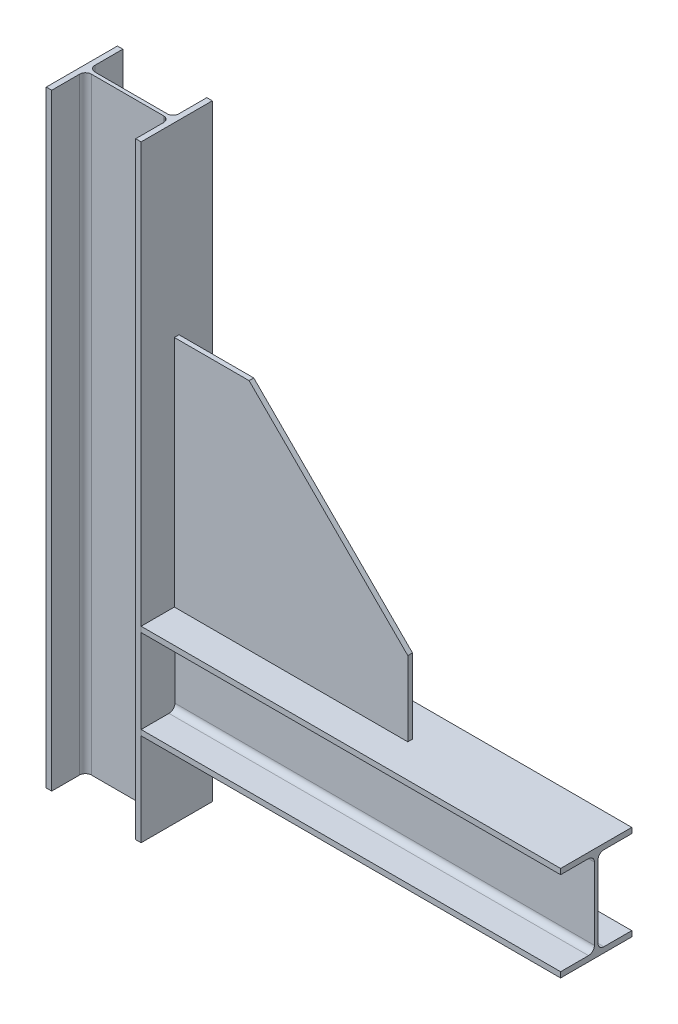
ISO-10303-21;
HEADER;
FILE_DESCRIPTION(('STEP AP214'),'2;1');
FILE_NAME('part.step','',(''),(''),'','','');
FILE_SCHEMA(('AUTOMOTIVE_DESIGN { 1 0 10303 214 1 1 1 1 }'));
ENDSEC;
DATA;
#1=APPLICATION_CONTEXT('core data for automotive mechanical design processes');
#2=APPLICATION_PROTOCOL_DEFINITION('international standard','automotive_design',2000,#1);
#3=PRODUCT_CONTEXT('',#1,'mechanical');
#4=PRODUCT('Part','Part','',(#3));
#5=PRODUCT_RELATED_PRODUCT_CATEGORY('part','',(#4));
#6=PRODUCT_DEFINITION_FORMATION('','',#4);
#7=PRODUCT_DEFINITION_CONTEXT('part definition',#1,'design');
#8=PRODUCT_DEFINITION('design','',#6,#7);
#9=PRODUCT_DEFINITION_SHAPE('','',#8);
#10=(LENGTH_UNIT() NAMED_UNIT(*) SI_UNIT(.MILLI.,.METRE.));
#11=(NAMED_UNIT(*) PLANE_ANGLE_UNIT() SI_UNIT($,.RADIAN.));
#12=(NAMED_UNIT(*) SI_UNIT($,.STERADIAN.) SOLID_ANGLE_UNIT());
#13=UNCERTAINTY_MEASURE_WITH_UNIT(LENGTH_MEASURE(1.E-05),#10,'distance_accuracy_value','');
#14=(GEOMETRIC_REPRESENTATION_CONTEXT(3) GLOBAL_UNCERTAINTY_ASSIGNED_CONTEXT((#13)) GLOBAL_UNIT_ASSIGNED_CONTEXT((#10,
#11,#12)) REPRESENTATION_CONTEXT('',''));
#15=CARTESIAN_POINT('',(0.,0.,0.));
#16=DIRECTION('',(0.,0.,1.));
#17=DIRECTION('',(1.,0.,0.));
#18=AXIS2_PLACEMENT_3D('',#15,#16,#17);
#19=CARTESIAN_POINT('',(50.8,300.8,2.50000000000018));
#20=DIRECTION('',(0.,-1.,0.));
#21=DIRECTION('',(0.,0.,-1.));
#22=AXIS2_PLACEMENT_3D('',#19,#20,#21);
#23=PLANE('',#22);
#24=DIRECTION('',(-1.,0.,0.));
#25=VECTOR('',#24,1.);
#26=CARTESIAN_POINT('',(50.8,300.8,-2.49999999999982));
#27=LINE('',#26,#25);
#28=CARTESIAN_POINT('',(130.8,300.8,-2.49999999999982));
#29=VERTEX_POINT('',#28);
#30=CARTESIAN_POINT('',(50.8,300.8,-2.49999999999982));
#31=VERTEX_POINT('',#30);
#32=EDGE_CURVE('E190',#29,#31,#27,.T.);
#33=ORIENTED_EDGE('',*,*,#32,.T.);
#34=DIRECTION('',(0.,0.,-1.));
#35=VECTOR('',#34,1.);
#36=CARTESIAN_POINT('',(50.8,300.8,2.50000000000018));
#37=LINE('',#36,#35);
#38=CARTESIAN_POINT('',(50.8,300.8,2.50000000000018));
#39=VERTEX_POINT('',#38);
#40=EDGE_CURVE('E14',#39,#31,#37,.T.);
#41=ORIENTED_EDGE('',*,*,#40,.F.);
#42=DIRECTION('',(-1.,0.,0.));
#43=VECTOR('',#42,1.);
#44=CARTESIAN_POINT('',(50.8,300.8,2.50000000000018));
#45=LINE('',#44,#43);
#46=CARTESIAN_POINT('',(130.8,300.8,2.50000000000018));
#47=VERTEX_POINT('',#46);
#48=EDGE_CURVE('E198',#47,#39,#45,.T.);
#49=ORIENTED_EDGE('',*,*,#48,.F.);
#50=DIRECTION('',(0.,0.,-1.));
#51=VECTOR('',#50,1.);
#52=CARTESIAN_POINT('',(130.8,300.8,2.50000000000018));
#53=LINE('',#52,#51);
#54=EDGE_CURVE('E186',#47,#29,#53,.T.);
#55=ORIENTED_EDGE('',*,*,#54,.T.);
#56=EDGE_LOOP('',(#33,#41,#49,#55));
#57=FACE_BOUND('',#56,.T.);
#58=ADVANCED_FACE('F116',(#57),#23,.F.);
#59=CARTESIAN_POINT('',(50.8000000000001,50.8,2.50000000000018));
#60=DIRECTION('',(1.,0.,0.));
#61=DIRECTION('',(0.,1.,0.));
#62=AXIS2_PLACEMENT_3D('',#59,#60,#61);
#63=PLANE('',#62);
#64=DIRECTION('',(0.,-1.,0.));
#65=VECTOR('',#64,1.);
#66=CARTESIAN_POINT('',(50.8000000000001,50.8,-2.49999999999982));
#67=LINE('',#66,#65);
#68=CARTESIAN_POINT('',(50.8000000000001,50.8,-2.49999999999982));
#69=VERTEX_POINT('',#68);
#70=EDGE_CURVE('E193',#31,#69,#67,.T.);
#71=ORIENTED_EDGE('',*,*,#70,.T.);
#72=DIRECTION('',(0.,0.,-1.));
#73=VECTOR('',#72,1.);
#74=CARTESIAN_POINT('',(50.8000000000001,50.8,2.50000000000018));
#75=LINE('',#74,#73);
#76=CARTESIAN_POINT('',(50.8000000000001,50.8,2.50000000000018));
#77=VERTEX_POINT('',#76);
#78=EDGE_CURVE('E124',#77,#69,#75,.T.);
#79=ORIENTED_EDGE('',*,*,#78,.F.);
#80=DIRECTION('',(0.,-1.,0.));
#81=VECTOR('',#80,1.);
#82=CARTESIAN_POINT('',(50.8000000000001,50.8,2.50000000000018));
#83=LINE('',#82,#81);
#84=EDGE_CURVE('E166',#39,#77,#83,.T.);
#85=ORIENTED_EDGE('',*,*,#84,.F.);
#86=ORIENTED_EDGE('',*,*,#40,.T.);
#87=EDGE_LOOP('',(#71,#79,#85,#86));
#88=FACE_BOUND('',#87,.T.);
#89=ADVANCED_FACE('F217',(#88),#63,.F.);
#90=CARTESIAN_POINT('',(50.8000000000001,50.8,2.50000000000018));
#91=DIRECTION('',(0.,1.,0.));
#92=DIRECTION('',(0.,0.,1.));
#93=AXIS2_PLACEMENT_3D('',#90,#91,#92);
#94=PLANE('',#93);
#95=DIRECTION('',(1.,0.,0.));
#96=VECTOR('',#95,1.);
#97=CARTESIAN_POINT('',(50.8000000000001,50.8,-2.49999999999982));
#98=LINE('',#97,#96);
#99=CARTESIAN_POINT('',(300.8,50.8,-2.49999999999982));
#100=VERTEX_POINT('',#99);
#101=EDGE_CURVE('E181',#69,#100,#98,.T.);
#102=ORIENTED_EDGE('',*,*,#101,.T.);
#103=DIRECTION('',(0.,0.,-1.));
#104=VECTOR('',#103,1.);
#105=CARTESIAN_POINT('',(300.8,50.8,2.50000000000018));
#106=LINE('',#105,#104);
#107=CARTESIAN_POINT('',(300.8,50.8,2.50000000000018));
#108=VERTEX_POINT('',#107);
#109=EDGE_CURVE('E178',#108,#100,#106,.T.);
#110=ORIENTED_EDGE('',*,*,#109,.F.);
#111=DIRECTION('',(1.,0.,0.));
#112=VECTOR('',#111,1.);
#113=CARTESIAN_POINT('',(50.8000000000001,50.8,2.50000000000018));
#114=LINE('',#113,#112);
#115=EDGE_CURVE('E170',#77,#108,#114,.T.);
#116=ORIENTED_EDGE('',*,*,#115,.F.);
#117=ORIENTED_EDGE('',*,*,#78,.T.);
#118=EDGE_LOOP('',(#102,#110,#116,#117));
#119=FACE_BOUND('',#118,.T.);
#120=ADVANCED_FACE('F179',(#119),#94,.F.);
#121=CARTESIAN_POINT('',(300.8,50.8,2.50000000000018));
#122=DIRECTION('',(-1.,0.,0.));
#123=DIRECTION('',(0.,0.,1.));
#124=AXIS2_PLACEMENT_3D('',#121,#122,#123);
#125=PLANE('',#124);
#126=DIRECTION('',(0.,1.,0.));
#127=VECTOR('',#126,1.);
#128=CARTESIAN_POINT('',(300.8,50.8,-2.49999999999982));
#129=LINE('',#128,#127);
#130=CARTESIAN_POINT('',(300.8,130.799999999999,-2.49999999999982));
#131=VERTEX_POINT('',#130);
#132=EDGE_CURVE('E152',#100,#131,#129,.T.);
#133=ORIENTED_EDGE('',*,*,#132,.T.);
#134=DIRECTION('',(0.,0.,-1.));
#135=VECTOR('',#134,1.);
#136=CARTESIAN_POINT('',(300.8,130.799999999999,2.50000000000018));
#137=LINE('',#136,#135);
#138=CARTESIAN_POINT('',(300.8,130.799999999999,2.50000000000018));
#139=VERTEX_POINT('',#138);
#140=EDGE_CURVE('E182',#139,#131,#137,.T.);
#141=ORIENTED_EDGE('',*,*,#140,.F.);
#142=DIRECTION('',(0.,1.,0.));
#143=VECTOR('',#142,1.);
#144=CARTESIAN_POINT('',(300.8,50.8,2.50000000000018));
#145=LINE('',#144,#143);
#146=EDGE_CURVE('E174',#108,#139,#145,.T.);
#147=ORIENTED_EDGE('',*,*,#146,.F.);
#148=ORIENTED_EDGE('',*,*,#109,.T.);
#149=EDGE_LOOP('',(#133,#141,#147,#148));
#150=FACE_BOUND('',#149,.T.);
#151=ADVANCED_FACE('F184',(#150),#125,.F.);
#152=CARTESIAN_POINT('',(130.8,300.8,2.50000000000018));
#153=DIRECTION('',(-0.707106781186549,-0.707106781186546,0.));
#154=DIRECTION('',(0.707106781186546,-0.707106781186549,0.));
#155=AXIS2_PLACEMENT_3D('',#152,#153,#154);
#156=PLANE('',#155);
#157=DIRECTION('',(-0.707106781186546,0.707106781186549,0.));
#158=VECTOR('',#157,1.);
#159=CARTESIAN_POINT('',(130.8,300.8,-2.49999999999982));
#160=LINE('',#159,#158);
#161=EDGE_CURVE('E158',#131,#29,#160,.T.);
#162=ORIENTED_EDGE('',*,*,#161,.T.);
#163=ORIENTED_EDGE('',*,*,#54,.F.);
#164=DIRECTION('',(-0.707106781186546,0.707106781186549,0.));
#165=VECTOR('',#164,1.);
#166=CARTESIAN_POINT('',(130.8,300.8,2.50000000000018));
#167=LINE('',#166,#165);
#168=EDGE_CURVE('E132',#139,#47,#167,.T.);
#169=ORIENTED_EDGE('',*,*,#168,.F.);
#170=ORIENTED_EDGE('',*,*,#140,.T.);
#171=EDGE_LOOP('',(#162,#163,#169,#170));
#172=FACE_BOUND('',#171,.T.);
#173=ADVANCED_FACE('F206',(#172),#156,.F.);
#174=CARTESIAN_POINT('',(0.,0.,2.50000000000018));
#175=DIRECTION('',(0.,0.,1.));
#176=DIRECTION('',(1.,0.,0.));
#177=AXIS2_PLACEMENT_3D('',#174,#175,#176);
#178=PLANE('',#177);
#179=ORIENTED_EDGE('',*,*,#48,.T.);
#180=ORIENTED_EDGE('',*,*,#84,.T.);
#181=ORIENTED_EDGE('',*,*,#115,.T.);
#182=ORIENTED_EDGE('',*,*,#146,.T.);
#183=ORIENTED_EDGE('',*,*,#168,.T.);
#184=EDGE_LOOP('',(#179,#180,#181,#182,#183));
#185=FACE_BOUND('',#184,.T.);
#186=ADVANCED_FACE('F172',(#185),#178,.T.);
#187=CARTESIAN_POINT('',(0.,0.,-2.49999999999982));
#188=DIRECTION('',(0.,0.,1.));
#189=DIRECTION('',(1.,0.,0.));
#190=AXIS2_PLACEMENT_3D('',#187,#188,#189);
#191=PLANE('',#190);
#192=ORIENTED_EDGE('',*,*,#32,.F.);
#193=ORIENTED_EDGE('',*,*,#161,.F.);
#194=ORIENTED_EDGE('',*,*,#132,.F.);
#195=ORIENTED_EDGE('',*,*,#101,.F.);
#196=ORIENTED_EDGE('',*,*,#70,.F.);
#197=EDGE_LOOP('',(#192,#193,#194,#195,#196));
#198=FACE_BOUND('',#197,.T.);
#199=ADVANCED_FACE('F202',(#198),#191,.F.);
#200=CLOSED_SHELL('',(#58,#89,#120,#151,#173,#186,#199));
#201=MANIFOLD_SOLID_BREP('B2',#200);
#202=CARTESIAN_POINT('',(500.,50.7999999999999,38.1000000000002));
#203=DIRECTION('',(0.,-1.,0.));
#204=DIRECTION('',(0.,0.,-1.));
#205=AXIS2_PLACEMENT_3D('',#202,#203,#204);
#206=PLANE('',#205);
#207=DIRECTION('',(0.,0.,-1.));
#208=VECTOR('',#207,1.);
#209=CARTESIAN_POINT('',(50.7999999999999,50.7999999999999,38.0999999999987));
#210=LINE('',#209,#208);
#211=CARTESIAN_POINT('',(50.7999999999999,50.7999999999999,38.1000000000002));
#212=VERTEX_POINT('',#211);
#213=CARTESIAN_POINT('',(50.8000000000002,50.8000000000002,-38.0999999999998));
#214=VERTEX_POINT('',#213);
#215=EDGE_CURVE('E403',#212,#214,#210,.T.);
#216=ORIENTED_EDGE('',*,*,#215,.F.);
#217=DIRECTION('',(-1.,0.,0.));
#218=VECTOR('',#217,1.);
#219=CARTESIAN_POINT('',(500.,50.7999999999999,38.1000000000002));
#220=LINE('',#219,#218);
#221=CARTESIAN_POINT('',(500.,50.7999999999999,38.1000000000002));
#222=VERTEX_POINT('',#221);
#223=EDGE_CURVE('E426',#222,#212,#220,.T.);
#224=ORIENTED_EDGE('',*,*,#223,.F.);
#225=DIRECTION('',(0.,0.,1.));
#226=VECTOR('',#225,1.);
#227=CARTESIAN_POINT('',(500.,50.7999999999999,38.1000000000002));
#228=LINE('',#227,#226);
#229=CARTESIAN_POINT('',(500.,50.8000000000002,-38.0999999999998));
#230=VERTEX_POINT('',#229);
#231=EDGE_CURVE('E425',#230,#222,#228,.T.);
#232=ORIENTED_EDGE('',*,*,#231,.F.);
#233=DIRECTION('',(-1.,0.,0.));
#234=VECTOR('',#233,1.);
#235=CARTESIAN_POINT('',(500.,50.8000000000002,-38.0999999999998));
#236=LINE('',#235,#234);
#237=EDGE_CURVE('E419',#230,#214,#236,.T.);
#238=ORIENTED_EDGE('',*,*,#237,.T.);
#239=EDGE_LOOP('',(#216,#224,#232,#238));
#240=FACE_BOUND('',#239,.T.);
#241=ADVANCED_FACE('F289',(#240),#206,.F.);
#242=CARTESIAN_POINT('',(500.,44.9579999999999,38.1000000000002));
#243=DIRECTION('',(0.,0.,-1.));
#244=DIRECTION('',(0.,1.,0.));
#245=AXIS2_PLACEMENT_3D('',#242,#243,#244);
#246=PLANE('',#245);
#247=DIRECTION('',(0.,1.,0.));
#248=VECTOR('',#247,1.);
#249=CARTESIAN_POINT('',(50.8,-150.,38.1000000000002));
#250=LINE('',#249,#248);
#251=CARTESIAN_POINT('',(50.7999999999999,44.9579999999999,38.1000000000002));
#252=VERTEX_POINT('',#251);
#253=EDGE_CURVE('E114',#252,#212,#250,.T.);
#254=ORIENTED_EDGE('',*,*,#253,.F.);
#255=DIRECTION('',(-1.,0.,0.));
#256=VECTOR('',#255,1.);
#257=CARTESIAN_POINT('',(500.,44.9579999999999,38.1000000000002));
#258=LINE('',#257,#256);
#259=CARTESIAN_POINT('',(500.,44.9579999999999,38.1000000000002));
#260=VERTEX_POINT('',#259);
#261=EDGE_CURVE('E428',#260,#252,#258,.T.);
#262=ORIENTED_EDGE('',*,*,#261,.F.);
#263=DIRECTION('',(0.,-1.,0.));
#264=VECTOR('',#263,1.);
#265=CARTESIAN_POINT('',(500.,44.9579999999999,38.1000000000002));
#266=LINE('',#265,#264);
#267=EDGE_CURVE('E441',#222,#260,#266,.T.);
#268=ORIENTED_EDGE('',*,*,#267,.F.);
#269=ORIENTED_EDGE('',*,*,#223,.T.);
#270=EDGE_LOOP('',(#254,#262,#268,#269));
#271=FACE_BOUND('',#270,.T.);
#272=ADVANCED_FACE('F557',(#271),#246,.F.);
#273=CARTESIAN_POINT('',(500.,44.9579999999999,8.25500000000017));
#274=DIRECTION('',(0.,1.,0.));
#275=DIRECTION('',(0.,0.,1.));
#276=AXIS2_PLACEMENT_3D('',#273,#274,#275);
#277=PLANE('',#276);
#278=DIRECTION('',(0.,0.,1.));
#279=VECTOR('',#278,1.);
#280=CARTESIAN_POINT('',(50.8,44.9579999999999,8.25499999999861));
#281=LINE('',#280,#279);
#282=CARTESIAN_POINT('',(50.8,44.958,8.25500000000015));
#283=VERTEX_POINT('',#282);
#284=EDGE_CURVE('E298',#283,#252,#281,.T.);
#285=ORIENTED_EDGE('',*,*,#284,.F.);
#286=DIRECTION('',(-1.,0.,0.));
#287=VECTOR('',#286,1.);
#288=CARTESIAN_POINT('',(500.,44.958,8.25500000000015));
#289=LINE('',#288,#287);
#290=CARTESIAN_POINT('',(500.,44.958,8.25500000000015));
#291=VERTEX_POINT('',#290);
#292=EDGE_CURVE('E471',#291,#283,#289,.T.);
#293=ORIENTED_EDGE('',*,*,#292,.F.);
#294=DIRECTION('',(0.,0.,-1.));
#295=VECTOR('',#294,1.);
#296=CARTESIAN_POINT('',(500.,44.9579999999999,8.25500000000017));
#297=LINE('',#296,#295);
#298=EDGE_CURVE('E444',#260,#291,#297,.T.);
#299=ORIENTED_EDGE('',*,*,#298,.F.);
#300=ORIENTED_EDGE('',*,*,#261,.T.);
#301=EDGE_LOOP('',(#285,#293,#299,#300));
#302=FACE_BOUND('',#301,.T.);
#303=ADVANCED_FACE('F554',(#302),#277,.F.);
#304=CARTESIAN_POINT('',(500.,38.608,8.25500000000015));
#305=DIRECTION('',(-1.,0.,0.));
#306=DIRECTION('',(0.,0.,1.));
#307=AXIS2_PLACEMENT_3D('',#304,#305,#306);
#308=CYLINDRICAL_SURFACE('',#307,6.34999999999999);
#309=CARTESIAN_POINT('',(50.8,38.608,8.25500000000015));
#310=DIRECTION('',(-1.,0.,0.));
#311=DIRECTION('',(0.,0.,1.));
#312=AXIS2_PLACEMENT_3D('',#309,#310,#311);
#313=CIRCLE('',#312,6.34999999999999);
#314=CARTESIAN_POINT('',(50.8000000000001,38.608,1.90500000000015));
#315=VERTEX_POINT('',#314);
#316=EDGE_CURVE('E449',#315,#283,#313,.F.);
#317=ORIENTED_EDGE('',*,*,#316,.F.);
#318=DIRECTION('',(-1.,0.,0.));
#319=VECTOR('',#318,1.);
#320=CARTESIAN_POINT('',(500.,38.608,1.90500000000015));
#321=LINE('',#320,#319);
#322=CARTESIAN_POINT('',(500.,38.608,1.90500000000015));
#323=VERTEX_POINT('',#322);
#324=EDGE_CURVE('E474',#323,#315,#321,.T.);
#325=ORIENTED_EDGE('',*,*,#324,.F.);
#326=CARTESIAN_POINT('',(500.,38.608,8.25500000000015));
#327=DIRECTION('',(-1.,0.,0.));
#328=DIRECTION('',(0.,1.,0.));
#329=AXIS2_PLACEMENT_3D('',#326,#327,#328);
#330=CIRCLE('',#329,6.34999999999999);
#331=EDGE_CURVE('E551',#291,#323,#330,.T.);
#332=ORIENTED_EDGE('',*,*,#331,.F.);
#333=ORIENTED_EDGE('',*,*,#292,.T.);
#334=EDGE_LOOP('',(#317,#325,#332,#333));
#335=FACE_BOUND('',#334,.T.);
#336=ADVANCED_FACE('F548',(#335),#308,.F.);
#337=CARTESIAN_POINT('',(500.,-38.608,1.90499999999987));
#338=DIRECTION('',(0.,0.,-1.));
#339=DIRECTION('',(0.,1.,0.));
#340=AXIS2_PLACEMENT_3D('',#337,#338,#339);
#341=PLANE('',#340);
#342=DIRECTION('',(0.,1.,0.));
#343=VECTOR('',#342,1.);
#344=CARTESIAN_POINT('',(50.8000000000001,-38.6080000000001,1.90499999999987));
#345=LINE('',#344,#343);
#346=CARTESIAN_POINT('',(50.8000000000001,-38.608,1.90499999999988));
#347=VERTEX_POINT('',#346);
#348=EDGE_CURVE('E451',#347,#315,#345,.T.);
#349=ORIENTED_EDGE('',*,*,#348,.F.);
#350=DIRECTION('',(-1.,0.,0.));
#351=VECTOR('',#350,1.);
#352=CARTESIAN_POINT('',(500.,-38.608,1.90499999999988));
#353=LINE('',#352,#351);
#354=CARTESIAN_POINT('',(500.,-38.608,1.90499999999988));
#355=VERTEX_POINT('',#354);
#356=EDGE_CURVE('E477',#355,#347,#353,.T.);
#357=ORIENTED_EDGE('',*,*,#356,.F.);
#358=DIRECTION('',(0.,-1.,0.));
#359=VECTOR('',#358,1.);
#360=CARTESIAN_POINT('',(500.,-38.608,1.90499999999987));
#361=LINE('',#360,#359);
#362=EDGE_CURVE('E543',#323,#355,#361,.T.);
#363=ORIENTED_EDGE('',*,*,#362,.F.);
#364=ORIENTED_EDGE('',*,*,#324,.T.);
#365=EDGE_LOOP('',(#349,#357,#363,#364));
#366=FACE_BOUND('',#365,.T.);
#367=ADVANCED_FACE('F542',(#366),#341,.F.);
#368=CARTESIAN_POINT('',(500.,-38.608,8.25499999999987));
#369=DIRECTION('',(-1.,0.,0.));
#370=DIRECTION('',(0.,0.,1.));
#371=AXIS2_PLACEMENT_3D('',#368,#369,#370);
#372=CYLINDRICAL_SURFACE('',#371,6.34999999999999);
#373=CARTESIAN_POINT('',(50.8000000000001,-38.608,8.25499999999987));
#374=DIRECTION('',(-1.,0.,0.));
#375=DIRECTION('',(0.,0.,1.));
#376=AXIS2_PLACEMENT_3D('',#373,#374,#375);
#377=CIRCLE('',#376,6.34999999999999);
#378=CARTESIAN_POINT('',(50.8000000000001,-44.958,8.25499999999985));
#379=VERTEX_POINT('',#378);
#380=EDGE_CURVE('E453',#379,#347,#377,.F.);
#381=ORIENTED_EDGE('',*,*,#380,.F.);
#382=DIRECTION('',(-1.,0.,0.));
#383=VECTOR('',#382,1.);
#384=CARTESIAN_POINT('',(500.,-44.958,8.25499999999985));
#385=LINE('',#384,#383);
#386=CARTESIAN_POINT('',(500.,-44.958,8.25499999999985));
#387=VERTEX_POINT('',#386);
#388=EDGE_CURVE('E480',#387,#379,#385,.T.);
#389=ORIENTED_EDGE('',*,*,#388,.F.);
#390=CARTESIAN_POINT('',(500.,-38.608,8.25499999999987));
#391=DIRECTION('',(-1.,0.,0.));
#392=DIRECTION('',(0.,1.,0.));
#393=AXIS2_PLACEMENT_3D('',#390,#391,#392);
#394=CIRCLE('',#393,6.34999999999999);
#395=EDGE_CURVE('E539',#355,#387,#394,.T.);
#396=ORIENTED_EDGE('',*,*,#395,.F.);
#397=ORIENTED_EDGE('',*,*,#356,.T.);
#398=EDGE_LOOP('',(#381,#389,#396,#397));
#399=FACE_BOUND('',#398,.T.);
#400=ADVANCED_FACE('F536',(#399),#372,.F.);
#401=CARTESIAN_POINT('',(500.,-44.9580000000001,38.0999999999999));
#402=DIRECTION('',(0.,-1.,0.));
#403=DIRECTION('',(0.,0.,-1.));
#404=AXIS2_PLACEMENT_3D('',#401,#402,#403);
#405=PLANE('',#404);
#406=DIRECTION('',(0.,0.,-1.));
#407=VECTOR('',#406,1.);
#408=CARTESIAN_POINT('',(50.8,-44.9580000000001,38.0999999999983));
#409=LINE('',#408,#407);
#410=CARTESIAN_POINT('',(50.8,-44.9580000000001,38.1000000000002));
#411=VERTEX_POINT('',#410);
#412=EDGE_CURVE('E455',#411,#379,#409,.T.);
#413=ORIENTED_EDGE('',*,*,#412,.F.);
#414=DIRECTION('',(-1.,0.,0.));
#415=VECTOR('',#414,1.);
#416=CARTESIAN_POINT('',(500.,-44.9580000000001,38.0999999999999));
#417=LINE('',#416,#415);
#418=CARTESIAN_POINT('',(500.,-44.9580000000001,38.0999999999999));
#419=VERTEX_POINT('',#418);
#420=EDGE_CURVE('E483',#419,#411,#417,.T.);
#421=ORIENTED_EDGE('',*,*,#420,.F.);
#422=DIRECTION('',(0.,0.,1.));
#423=VECTOR('',#422,1.);
#424=CARTESIAN_POINT('',(500.,-44.9580000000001,38.0999999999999));
#425=LINE('',#424,#423);
#426=EDGE_CURVE('E531',#387,#419,#425,.T.);
#427=ORIENTED_EDGE('',*,*,#426,.F.);
#428=ORIENTED_EDGE('',*,*,#388,.T.);
#429=EDGE_LOOP('',(#413,#421,#427,#428));
#430=FACE_BOUND('',#429,.T.);
#431=ADVANCED_FACE('F530',(#430),#405,.F.);
#432=CARTESIAN_POINT('',(500.,-50.8000000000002,38.0999999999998));
#433=DIRECTION('',(0.,0.,-1.));
#434=DIRECTION('',(0.,1.,0.));
#435=AXIS2_PLACEMENT_3D('',#432,#433,#434);
#436=PLANE('',#435);
#437=CARTESIAN_POINT('',(50.8,-50.8000000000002,38.1000000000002));
#438=VERTEX_POINT('',#437);
#439=EDGE_CURVE('E300',#438,#411,#250,.T.);
#440=ORIENTED_EDGE('',*,*,#439,.F.);
#441=DIRECTION('',(-1.,0.,0.));
#442=VECTOR('',#441,1.);
#443=CARTESIAN_POINT('',(500.,-50.8000000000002,38.0999999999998));
#444=LINE('',#443,#442);
#445=CARTESIAN_POINT('',(500.,-50.8000000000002,38.0999999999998));
#446=VERTEX_POINT('',#445);
#447=EDGE_CURVE('E467',#446,#438,#444,.T.);
#448=ORIENTED_EDGE('',*,*,#447,.F.);
#449=DIRECTION('',(0.,-1.,0.));
#450=VECTOR('',#449,1.);
#451=CARTESIAN_POINT('',(500.,-50.8000000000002,38.0999999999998));
#452=LINE('',#451,#450);
#453=EDGE_CURVE('E526',#419,#446,#452,.T.);
#454=ORIENTED_EDGE('',*,*,#453,.F.);
#455=ORIENTED_EDGE('',*,*,#420,.T.);
#456=EDGE_LOOP('',(#440,#448,#454,#455));
#457=FACE_BOUND('',#456,.T.);
#458=ADVANCED_FACE('F525',(#457),#436,.F.);
#459=CARTESIAN_POINT('',(500.,-50.7999999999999,-38.1000000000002));
#460=DIRECTION('',(0.,1.,0.));
#461=DIRECTION('',(0.,0.,1.));
#462=AXIS2_PLACEMENT_3D('',#459,#460,#461);
#463=PLANE('',#462);
#464=DIRECTION('',(0.,0.,1.));
#465=VECTOR('',#464,1.);
#466=CARTESIAN_POINT('',(50.8000000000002,-50.7999999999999,-38.1000000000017));
#467=LINE('',#466,#465);
#468=CARTESIAN_POINT('',(50.8000000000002,-50.7999999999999,-38.0999999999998));
#469=VERTEX_POINT('',#468);
#470=EDGE_CURVE('E324',#469,#438,#467,.T.);
#471=ORIENTED_EDGE('',*,*,#470,.F.);
#472=DIRECTION('',(-1.,0.,0.));
#473=VECTOR('',#472,1.);
#474=CARTESIAN_POINT('',(500.,-50.7999999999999,-38.1000000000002));
#475=LINE('',#474,#473);
#476=CARTESIAN_POINT('',(500.,-50.7999999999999,-38.1000000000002));
#477=VERTEX_POINT('',#476);
#478=EDGE_CURVE('E466',#477,#469,#475,.T.);
#479=ORIENTED_EDGE('',*,*,#478,.F.);
#480=DIRECTION('',(0.,0.,-1.));
#481=VECTOR('',#480,1.);
#482=CARTESIAN_POINT('',(500.,-50.7999999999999,-38.1000000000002));
#483=LINE('',#482,#481);
#484=EDGE_CURVE('E521',#446,#477,#483,.T.);
#485=ORIENTED_EDGE('',*,*,#484,.F.);
#486=ORIENTED_EDGE('',*,*,#447,.T.);
#487=EDGE_LOOP('',(#471,#479,#485,#486));
#488=FACE_BOUND('',#487,.T.);
#489=ADVANCED_FACE('F520',(#488),#463,.F.);
#490=CARTESIAN_POINT('',(500.,-44.9579999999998,-38.1000000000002));
#491=DIRECTION('',(0.,0.,1.));
#492=DIRECTION('',(0.,-1.,0.));
#493=AXIS2_PLACEMENT_3D('',#490,#491,#492);
#494=PLANE('',#493);
#495=DIRECTION('',(0.,1.,0.));
#496=VECTOR('',#495,1.);
#497=CARTESIAN_POINT('',(50.8000000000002,-150.,-38.0999999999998));
#498=LINE('',#497,#496);
#499=CARTESIAN_POINT('',(50.8000000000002,-44.9579999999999,-38.0999999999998));
#500=VERTEX_POINT('',#499);
#501=EDGE_CURVE('E328',#469,#500,#498,.T.);
#502=ORIENTED_EDGE('',*,*,#501,.T.);
#503=DIRECTION('',(-1.,0.,0.));
#504=VECTOR('',#503,1.);
#505=CARTESIAN_POINT('',(500.,-44.9579999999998,-38.1000000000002));
#506=LINE('',#505,#504);
#507=CARTESIAN_POINT('',(500.,-44.9579999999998,-38.1000000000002));
#508=VERTEX_POINT('',#507);
#509=EDGE_CURVE('E490',#508,#500,#506,.T.);
#510=ORIENTED_EDGE('',*,*,#509,.F.);
#511=DIRECTION('',(0.,1.,0.));
#512=VECTOR('',#511,1.);
#513=CARTESIAN_POINT('',(500.,-44.9579999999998,-38.1000000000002));
#514=LINE('',#513,#512);
#515=EDGE_CURVE('E516',#477,#508,#514,.T.);
#516=ORIENTED_EDGE('',*,*,#515,.F.);
#517=ORIENTED_EDGE('',*,*,#478,.T.);
#518=EDGE_LOOP('',(#502,#510,#516,#517));
#519=FACE_BOUND('',#518,.T.);
#520=ADVANCED_FACE('F515',(#519),#494,.F.);
#521=CARTESIAN_POINT('',(500.,-44.9579999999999,-8.25500000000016));
#522=DIRECTION('',(0.,-1.,0.));
#523=DIRECTION('',(0.,0.,-1.));
#524=AXIS2_PLACEMENT_3D('',#521,#522,#523);
#525=PLANE('',#524);
#526=DIRECTION('',(0.,0.,-1.));
#527=VECTOR('',#526,1.);
#528=CARTESIAN_POINT('',(50.8000000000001,-44.9579999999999,-8.25500000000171));
#529=LINE('',#528,#527);
#530=CARTESIAN_POINT('',(50.8000000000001,-44.958,-8.25500000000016));
#531=VERTEX_POINT('',#530);
#532=EDGE_CURVE('E332',#531,#500,#529,.T.);
#533=ORIENTED_EDGE('',*,*,#532,.F.);
#534=DIRECTION('',(-1.,0.,0.));
#535=VECTOR('',#534,1.);
#536=CARTESIAN_POINT('',(500.,-44.958,-8.25500000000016));
#537=LINE('',#536,#535);
#538=CARTESIAN_POINT('',(500.,-44.958,-8.25500000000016));
#539=VERTEX_POINT('',#538);
#540=EDGE_CURVE('E492',#539,#531,#537,.T.);
#541=ORIENTED_EDGE('',*,*,#540,.F.);
#542=DIRECTION('',(0.,0.,1.));
#543=VECTOR('',#542,1.);
#544=CARTESIAN_POINT('',(500.,-44.9579999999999,-8.25500000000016));
#545=LINE('',#544,#543);
#546=EDGE_CURVE('E512',#508,#539,#545,.T.);
#547=ORIENTED_EDGE('',*,*,#546,.F.);
#548=ORIENTED_EDGE('',*,*,#509,.T.);
#549=EDGE_LOOP('',(#533,#541,#547,#548));
#550=FACE_BOUND('',#549,.T.);
#551=ADVANCED_FACE('F509',(#550),#525,.F.);
#552=CARTESIAN_POINT('',(500.,-38.608,-8.25500000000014));
#553=DIRECTION('',(-1.,0.,0.));
#554=DIRECTION('',(0.,0.,1.));
#555=AXIS2_PLACEMENT_3D('',#552,#553,#554);
#556=CYLINDRICAL_SURFACE('',#555,6.34999999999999);
#557=CARTESIAN_POINT('',(50.8000000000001,-38.608,-8.25500000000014));
#558=DIRECTION('',(-1.,0.,0.));
#559=DIRECTION('',(0.,0.,1.));
#560=AXIS2_PLACEMENT_3D('',#557,#558,#559);
#561=CIRCLE('',#560,6.34999999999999);
#562=CARTESIAN_POINT('',(50.8,-38.608,-1.90500000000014));
#563=VERTEX_POINT('',#562);
#564=EDGE_CURVE('E459',#563,#531,#561,.F.);
#565=ORIENTED_EDGE('',*,*,#564,.F.);
#566=DIRECTION('',(-1.,0.,0.));
#567=VECTOR('',#566,1.);
#568=CARTESIAN_POINT('',(500.,-38.608,-1.90500000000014));
#569=LINE('',#568,#567);
#570=CARTESIAN_POINT('',(500.,-38.608,-1.90500000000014));
#571=VERTEX_POINT('',#570);
#572=EDGE_CURVE('E432',#571,#563,#569,.T.);
#573=ORIENTED_EDGE('',*,*,#572,.F.);
#574=CARTESIAN_POINT('',(500.,-38.608,-8.25500000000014));
#575=DIRECTION('',(-1.,0.,0.));
#576=DIRECTION('',(0.,1.,0.));
#577=AXIS2_PLACEMENT_3D('',#574,#575,#576);
#578=CIRCLE('',#577,6.34999999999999);
#579=EDGE_CURVE('E507',#539,#571,#578,.T.);
#580=ORIENTED_EDGE('',*,*,#579,.F.);
#581=ORIENTED_EDGE('',*,*,#540,.T.);
#582=EDGE_LOOP('',(#565,#573,#580,#581));
#583=FACE_BOUND('',#582,.T.);
#584=ADVANCED_FACE('F506',(#583),#556,.F.);
#585=CARTESIAN_POINT('',(500.,38.608,-1.90499999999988));
#586=DIRECTION('',(0.,0.,1.));
#587=DIRECTION('',(0.,-1.,0.));
#588=AXIS2_PLACEMENT_3D('',#585,#586,#587);
#589=PLANE('',#588);
#590=DIRECTION('',(0.,-1.,0.));
#591=VECTOR('',#590,1.);
#592=CARTESIAN_POINT('',(50.8,38.6079999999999,-1.90499999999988));
#593=LINE('',#592,#591);
#594=CARTESIAN_POINT('',(50.8,38.608,-1.90499999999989));
#595=VERTEX_POINT('',#594);
#596=EDGE_CURVE('E461',#595,#563,#593,.T.);
#597=ORIENTED_EDGE('',*,*,#596,.F.);
#598=DIRECTION('',(-1.,0.,0.));
#599=VECTOR('',#598,1.);
#600=CARTESIAN_POINT('',(500.,38.608,-1.90499999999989));
#601=LINE('',#600,#599);
#602=CARTESIAN_POINT('',(500.,38.608,-1.90499999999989));
#603=VERTEX_POINT('',#602);
#604=EDGE_CURVE('E434',#603,#595,#601,.T.);
#605=ORIENTED_EDGE('',*,*,#604,.F.);
#606=DIRECTION('',(0.,1.,0.));
#607=VECTOR('',#606,1.);
#608=CARTESIAN_POINT('',(500.,38.608,-1.90499999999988));
#609=LINE('',#608,#607);
#610=EDGE_CURVE('E505',#571,#603,#609,.T.);
#611=ORIENTED_EDGE('',*,*,#610,.F.);
#612=ORIENTED_EDGE('',*,*,#572,.T.);
#613=EDGE_LOOP('',(#597,#605,#611,#612));
#614=FACE_BOUND('',#613,.T.);
#615=ADVANCED_FACE('F503',(#614),#589,.F.);
#616=CARTESIAN_POINT('',(500.,38.608,-8.25499999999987));
#617=DIRECTION('',(-1.,0.,0.));
#618=DIRECTION('',(0.,0.,1.));
#619=AXIS2_PLACEMENT_3D('',#616,#617,#618);
#620=CYLINDRICAL_SURFACE('',#619,6.34999999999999);
#621=CARTESIAN_POINT('',(50.8000000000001,38.608,-8.25499999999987));
#622=DIRECTION('',(-1.,0.,0.));
#623=DIRECTION('',(0.,0.,1.));
#624=AXIS2_PLACEMENT_3D('',#621,#622,#623);
#625=CIRCLE('',#624,6.34999999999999);
#626=CARTESIAN_POINT('',(50.8000000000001,44.958,-8.25499999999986));
#627=VERTEX_POINT('',#626);
#628=EDGE_CURVE('E463',#627,#595,#625,.F.);
#629=ORIENTED_EDGE('',*,*,#628,.F.);
#630=DIRECTION('',(-1.,0.,0.));
#631=VECTOR('',#630,1.);
#632=CARTESIAN_POINT('',(500.,44.958,-8.25499999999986));
#633=LINE('',#632,#631);
#634=CARTESIAN_POINT('',(500.,44.958,-8.25499999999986));
#635=VERTEX_POINT('',#634);
#636=EDGE_CURVE('E436',#635,#627,#633,.T.);
#637=ORIENTED_EDGE('',*,*,#636,.F.);
#638=CARTESIAN_POINT('',(500.,38.608,-8.25499999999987));
#639=DIRECTION('',(-1.,0.,0.));
#640=DIRECTION('',(0.,1.,0.));
#641=AXIS2_PLACEMENT_3D('',#638,#639,#640);
#642=CIRCLE('',#641,6.34999999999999);
#643=EDGE_CURVE('E570',#603,#635,#642,.T.);
#644=ORIENTED_EDGE('',*,*,#643,.F.);
#645=ORIENTED_EDGE('',*,*,#604,.T.);
#646=EDGE_LOOP('',(#629,#637,#644,#645));
#647=FACE_BOUND('',#646,.T.);
#648=ADVANCED_FACE('F578',(#647),#620,.F.);
#649=CARTESIAN_POINT('',(500.,44.9580000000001,-38.0999999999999));
#650=DIRECTION('',(0.,1.,0.));
#651=DIRECTION('',(0.,0.,1.));
#652=AXIS2_PLACEMENT_3D('',#649,#650,#651);
#653=PLANE('',#652);
#654=DIRECTION('',(0.,0.,1.));
#655=VECTOR('',#654,1.);
#656=CARTESIAN_POINT('',(50.8000000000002,44.9580000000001,-38.1000000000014));
#657=LINE('',#656,#655);
#658=CARTESIAN_POINT('',(50.8000000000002,44.9580000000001,-38.0999999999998));
#659=VERTEX_POINT('',#658);
#660=EDGE_CURVE('E422',#659,#627,#657,.T.);
#661=ORIENTED_EDGE('',*,*,#660,.F.);
#662=DIRECTION('',(-1.,0.,0.));
#663=VECTOR('',#662,1.);
#664=CARTESIAN_POINT('',(500.,44.9580000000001,-38.0999999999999));
#665=LINE('',#664,#663);
#666=CARTESIAN_POINT('',(500.,44.9580000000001,-38.0999999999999));
#667=VERTEX_POINT('',#666);
#668=EDGE_CURVE('E292',#667,#659,#665,.T.);
#669=ORIENTED_EDGE('',*,*,#668,.F.);
#670=DIRECTION('',(0.,0.,-1.));
#671=VECTOR('',#670,1.);
#672=CARTESIAN_POINT('',(500.,44.9580000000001,-38.0999999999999));
#673=LINE('',#672,#671);
#674=EDGE_CURVE('E572',#635,#667,#673,.T.);
#675=ORIENTED_EDGE('',*,*,#674,.F.);
#676=ORIENTED_EDGE('',*,*,#636,.T.);
#677=EDGE_LOOP('',(#661,#669,#675,#676));
#678=FACE_BOUND('',#677,.T.);
#679=ADVANCED_FACE('F575',(#678),#653,.F.);
#680=CARTESIAN_POINT('',(500.,50.8000000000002,-38.0999999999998));
#681=DIRECTION('',(0.,0.,1.));
#682=DIRECTION('',(0.,-1.,0.));
#683=AXIS2_PLACEMENT_3D('',#680,#681,#682);
#684=PLANE('',#683);
#685=DIRECTION('',(0.,-1.,0.));
#686=VECTOR('',#685,1.);
#687=CARTESIAN_POINT('',(50.8000000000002,50.8000000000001,-38.0999999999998));
#688=LINE('',#687,#686);
#689=EDGE_CURVE('E406',#214,#659,#688,.T.);
#690=ORIENTED_EDGE('',*,*,#689,.F.);
#691=ORIENTED_EDGE('',*,*,#237,.F.);
#692=DIRECTION('',(0.,1.,0.));
#693=VECTOR('',#692,1.);
#694=CARTESIAN_POINT('',(500.,50.8000000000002,-38.0999999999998));
#695=LINE('',#694,#693);
#696=EDGE_CURVE('E412',#667,#230,#695,.T.);
#697=ORIENTED_EDGE('',*,*,#696,.F.);
#698=ORIENTED_EDGE('',*,*,#668,.T.);
#699=EDGE_LOOP('',(#690,#691,#697,#698));
#700=FACE_BOUND('',#699,.T.);
#701=ADVANCED_FACE('F417',(#700),#684,.F.);
#702=CARTESIAN_POINT('',(500.,38.608,-8.25499999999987));
#703=DIRECTION('',(1.,0.,0.));
#704=DIRECTION('',(0.,1.,0.));
#705=AXIS2_PLACEMENT_3D('',#702,#703,#704);
#706=PLANE('',#705);
#707=ORIENTED_EDGE('',*,*,#231,.T.);
#708=ORIENTED_EDGE('',*,*,#267,.T.);
#709=ORIENTED_EDGE('',*,*,#298,.T.);
#710=ORIENTED_EDGE('',*,*,#331,.T.);
#711=ORIENTED_EDGE('',*,*,#362,.T.);
#712=ORIENTED_EDGE('',*,*,#395,.T.);
#713=ORIENTED_EDGE('',*,*,#426,.T.);
#714=ORIENTED_EDGE('',*,*,#453,.T.);
#715=ORIENTED_EDGE('',*,*,#484,.T.);
#716=ORIENTED_EDGE('',*,*,#515,.T.);
#717=ORIENTED_EDGE('',*,*,#546,.T.);
#718=ORIENTED_EDGE('',*,*,#579,.T.);
#719=ORIENTED_EDGE('',*,*,#610,.T.);
#720=ORIENTED_EDGE('',*,*,#643,.T.);
#721=ORIENTED_EDGE('',*,*,#674,.T.);
#722=ORIENTED_EDGE('',*,*,#696,.T.);
#723=EDGE_LOOP('',(#707,#708,#709,#710,#711,#712,#713,#714,#715,#716,#717,#718,#719,#720,#721,#722));
#724=FACE_BOUND('',#723,.T.);
#725=ADVANCED_FACE('F558',(#724),#706,.T.);
#726=CARTESIAN_POINT('',(50.8,-150.,38.1000000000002));
#727=DIRECTION('',(-1.,0.,0.));
#728=DIRECTION('',(0.,0.,1.));
#729=AXIS2_PLACEMENT_3D('',#726,#727,#728);
#730=PLANE('',#729);
#731=ORIENTED_EDGE('',*,*,#215,.T.);
#732=ORIENTED_EDGE('',*,*,#689,.T.);
#733=ORIENTED_EDGE('',*,*,#660,.T.);
#734=ORIENTED_EDGE('',*,*,#628,.T.);
#735=ORIENTED_EDGE('',*,*,#596,.T.);
#736=ORIENTED_EDGE('',*,*,#564,.T.);
#737=ORIENTED_EDGE('',*,*,#532,.T.);
#738=ORIENTED_EDGE('',*,*,#501,.F.);
#739=ORIENTED_EDGE('',*,*,#470,.T.);
#740=ORIENTED_EDGE('',*,*,#439,.T.);
#741=ORIENTED_EDGE('',*,*,#412,.T.);
#742=ORIENTED_EDGE('',*,*,#380,.T.);
#743=ORIENTED_EDGE('',*,*,#348,.T.);
#744=ORIENTED_EDGE('',*,*,#316,.T.);
#745=ORIENTED_EDGE('',*,*,#284,.T.);
#746=ORIENTED_EDGE('',*,*,#253,.T.);
#747=EDGE_LOOP('',(#731,#732,#733,#734,#735,#736,#737,#738,#739,#740,#741,#742,#743,#744,#745,#746));
#748=FACE_BOUND('',#747,.T.);
#749=ADVANCED_FACE('F405',(#748),#730,.T.);
#750=CLOSED_SHELL('',(#241,#272,#303,#336,#367,#400,#431,#458,#489,#520,#551,#584,#615,#648,
#679,#701,#725,#749));
#751=MANIFOLD_SOLID_BREP('B8',#750);
#752=CARTESIAN_POINT('',(50.8,-150.,38.1000000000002));
#753=DIRECTION('',(-1.,0.,0.));
#754=DIRECTION('',(0.,0.,1.));
#755=AXIS2_PLACEMENT_3D('',#752,#753,#754);
#756=PLANE('',#755);
#757=DIRECTION('',(0.,0.,1.));
#758=VECTOR('',#757,1.);
#759=CARTESIAN_POINT('',(50.7999999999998,500.,38.1000000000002));
#760=LINE('',#759,#758);
#761=CARTESIAN_POINT('',(50.8000000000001,500.,-38.0999999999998));
#762=VERTEX_POINT('',#761);
#763=CARTESIAN_POINT('',(50.7999999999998,500.,38.1000000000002));
#764=VERTEX_POINT('',#763);
#765=EDGE_CURVE('E962',#762,#764,#760,.T.);
#766=ORIENTED_EDGE('',*,*,#765,.T.);
#767=DIRECTION('',(0.,1.,0.));
#768=VECTOR('',#767,1.);
#769=CARTESIAN_POINT('',(50.8,-150.,38.1000000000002));
#770=LINE('',#769,#768);
#771=CARTESIAN_POINT('',(50.8,-150.,38.1000000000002));
#772=VERTEX_POINT('',#771);
#773=EDGE_CURVE('E287',#772,#764,#770,.T.);
#774=ORIENTED_EDGE('',*,*,#773,.F.);
#775=DIRECTION('',(0.,0.,1.));
#776=VECTOR('',#775,1.);
#777=CARTESIAN_POINT('',(50.8,-150.,38.1000000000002));
#778=LINE('',#777,#776);
#779=CARTESIAN_POINT('',(50.8000000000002,-150.,-38.0999999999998));
#780=VERTEX_POINT('',#779);
#781=EDGE_CURVE('E1008',#780,#772,#778,.T.);
#782=ORIENTED_EDGE('',*,*,#781,.F.);
#783=DIRECTION('',(0.,1.,0.));
#784=VECTOR('',#783,1.);
#785=CARTESIAN_POINT('',(50.8000000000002,-150.,-38.0999999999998));
#786=LINE('',#785,#784);
#787=EDGE_CURVE('E958',#780,#762,#786,.T.);
#788=ORIENTED_EDGE('',*,*,#787,.T.);
#789=EDGE_LOOP('',(#766,#774,#782,#788));
#790=FACE_BOUND('',#789,.T.);
#791=ADVANCED_FACE('F813',(#790),#756,.F.);
#792=CARTESIAN_POINT('',(44.9579999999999,-150.,38.1000000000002));
#793=DIRECTION('',(0.,0.,-1.));
#794=DIRECTION('',(-1.,0.,0.));
#795=AXIS2_PLACEMENT_3D('',#792,#793,#794);
#796=PLANE('',#795);
#797=DIRECTION('',(-1.,0.,0.));
#798=VECTOR('',#797,1.);
#799=CARTESIAN_POINT('',(44.9579999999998,500.,38.1000000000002));
#800=LINE('',#799,#798);
#801=CARTESIAN_POINT('',(44.9579999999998,500.,38.1000000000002));
#802=VERTEX_POINT('',#801);
#803=EDGE_CURVE('E966',#764,#802,#800,.T.);
#804=ORIENTED_EDGE('',*,*,#803,.T.);
#805=DIRECTION('',(0.,1.,0.));
#806=VECTOR('',#805,1.);
#807=CARTESIAN_POINT('',(44.9579999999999,-150.,38.1000000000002));
#808=LINE('',#807,#806);
#809=CARTESIAN_POINT('',(44.9579999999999,-150.,38.1000000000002));
#810=VERTEX_POINT('',#809);
#811=EDGE_CURVE('E822',#810,#802,#808,.T.);
#812=ORIENTED_EDGE('',*,*,#811,.F.);
#813=DIRECTION('',(-1.,0.,0.));
#814=VECTOR('',#813,1.);
#815=CARTESIAN_POINT('',(44.9579999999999,-150.,38.1000000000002));
#816=LINE('',#815,#814);
#817=EDGE_CURVE('E897',#772,#810,#816,.T.);
#818=ORIENTED_EDGE('',*,*,#817,.F.);
#819=ORIENTED_EDGE('',*,*,#773,.T.);
#820=EDGE_LOOP('',(#804,#812,#818,#819));
#821=FACE_BOUND('',#820,.T.);
#822=ADVANCED_FACE('F1130',(#821),#796,.F.);
#823=CARTESIAN_POINT('',(44.958,-150.,8.25500000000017));
#824=DIRECTION('',(1.,0.,0.));
#825=DIRECTION('',(0.,0.,-1.));
#826=AXIS2_PLACEMENT_3D('',#823,#824,#825);
#827=PLANE('',#826);
#828=DIRECTION('',(0.,0.,-1.));
#829=VECTOR('',#828,1.);
#830=CARTESIAN_POINT('',(44.9579999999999,500.,8.25500000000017));
#831=LINE('',#830,#829);
#832=CARTESIAN_POINT('',(44.9579999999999,500.,8.25500000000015));
#833=VERTEX_POINT('',#832);
#834=EDGE_CURVE('E969',#802,#833,#831,.T.);
#835=ORIENTED_EDGE('',*,*,#834,.T.);
#836=DIRECTION('',(0.,1.,0.));
#837=VECTOR('',#836,1.);
#838=CARTESIAN_POINT('',(44.958,-150.,8.25500000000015));
#839=LINE('',#838,#837);
#840=CARTESIAN_POINT('',(44.958,-150.,8.25500000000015));
#841=VERTEX_POINT('',#840);
#842=EDGE_CURVE('E1051',#841,#833,#839,.T.);
#843=ORIENTED_EDGE('',*,*,#842,.F.);
#844=DIRECTION('',(0.,0.,-1.));
#845=VECTOR('',#844,1.);
#846=CARTESIAN_POINT('',(44.958,-150.,8.25500000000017));
#847=LINE('',#846,#845);
#848=EDGE_CURVE('E1061',#810,#841,#847,.T.);
#849=ORIENTED_EDGE('',*,*,#848,.F.);
#850=ORIENTED_EDGE('',*,*,#811,.T.);
#851=EDGE_LOOP('',(#835,#843,#849,#850));
#852=FACE_BOUND('',#851,.T.);
#853=ADVANCED_FACE('F1059',(#852),#827,.F.);
#854=CARTESIAN_POINT('',(38.6080000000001,-150.,8.25500000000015));
#855=DIRECTION('',(0.,1.,0.));
#856=DIRECTION('',(-1.,0.,0.));
#857=AXIS2_PLACEMENT_3D('',#854,#855,#856);
#858=CYLINDRICAL_SURFACE('',#857,6.34999999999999);
#859=CARTESIAN_POINT('',(38.6079999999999,500.,8.25500000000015));
#860=DIRECTION('',(0.,1.,0.));
#861=DIRECTION('',(1.,0.,0.));
#862=AXIS2_PLACEMENT_3D('',#859,#860,#861);
#863=CIRCLE('',#862,6.34999999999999);
#864=CARTESIAN_POINT('',(38.6079999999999,500.,1.90500000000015));
#865=VERTEX_POINT('',#864);
#866=EDGE_CURVE('E972',#833,#865,#863,.T.);
#867=ORIENTED_EDGE('',*,*,#866,.T.);
#868=DIRECTION('',(0.,1.,0.));
#869=VECTOR('',#868,1.);
#870=CARTESIAN_POINT('',(38.6080000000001,-150.,1.90500000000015));
#871=LINE('',#870,#869);
#872=CARTESIAN_POINT('',(38.6080000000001,-150.,1.90500000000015));
#873=VERTEX_POINT('',#872);
#874=EDGE_CURVE('E1047',#873,#865,#871,.T.);
#875=ORIENTED_EDGE('',*,*,#874,.F.);
#876=CARTESIAN_POINT('',(38.6080000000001,-150.,8.25500000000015));
#877=DIRECTION('',(0.,1.,0.));
#878=DIRECTION('',(1.,0.,0.));
#879=AXIS2_PLACEMENT_3D('',#876,#877,#878);
#880=CIRCLE('',#879,6.34999999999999);
#881=EDGE_CURVE('E1080',#841,#873,#880,.T.);
#882=ORIENTED_EDGE('',*,*,#881,.F.);
#883=ORIENTED_EDGE('',*,*,#842,.T.);
#884=EDGE_LOOP('',(#867,#875,#882,#883));
#885=FACE_BOUND('',#884,.T.);
#886=ADVANCED_FACE('F1070',(#885),#858,.F.);
#887=CARTESIAN_POINT('',(-38.6079999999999,-150.,1.90499999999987));
#888=DIRECTION('',(0.,0.,-1.));
#889=DIRECTION('',(-1.,0.,0.));
#890=AXIS2_PLACEMENT_3D('',#887,#888,#889);
#891=PLANE('',#890);
#892=DIRECTION('',(-1.,0.,0.));
#893=VECTOR('',#892,1.);
#894=CARTESIAN_POINT('',(-38.6080000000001,500.,1.90499999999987));
#895=LINE('',#894,#893);
#896=CARTESIAN_POINT('',(-38.6080000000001,500.,1.90499999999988));
#897=VERTEX_POINT('',#896);
#898=EDGE_CURVE('E975',#865,#897,#895,.T.);
#899=ORIENTED_EDGE('',*,*,#898,.T.);
#900=DIRECTION('',(0.,1.,0.));
#901=VECTOR('',#900,1.);
#902=CARTESIAN_POINT('',(-38.6079999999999,-150.,1.90499999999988));
#903=LINE('',#902,#901);
#904=CARTESIAN_POINT('',(-38.6079999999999,-150.,1.90499999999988));
#905=VERTEX_POINT('',#904);
#906=EDGE_CURVE('E1043',#905,#897,#903,.T.);
#907=ORIENTED_EDGE('',*,*,#906,.F.);
#908=DIRECTION('',(-1.,0.,0.));
#909=VECTOR('',#908,1.);
#910=CARTESIAN_POINT('',(-38.6079999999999,-150.,1.90499999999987));
#911=LINE('',#910,#909);
#912=EDGE_CURVE('E1076',#873,#905,#911,.T.);
#913=ORIENTED_EDGE('',*,*,#912,.F.);
#914=ORIENTED_EDGE('',*,*,#874,.T.);
#915=EDGE_LOOP('',(#899,#907,#913,#914));
#916=FACE_BOUND('',#915,.T.);
#917=ADVANCED_FACE('F1074',(#916),#891,.F.);
#918=CARTESIAN_POINT('',(-38.6079999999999,-150.,8.25499999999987));
#919=DIRECTION('',(0.,1.,0.));
#920=DIRECTION('',(-1.,0.,0.));
#921=AXIS2_PLACEMENT_3D('',#918,#919,#920);
#922=CYLINDRICAL_SURFACE('',#921,6.34999999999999);
#923=CARTESIAN_POINT('',(-38.6080000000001,500.,8.25499999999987));
#924=DIRECTION('',(0.,1.,0.));
#925=DIRECTION('',(1.,0.,0.));
#926=AXIS2_PLACEMENT_3D('',#923,#924,#925);
#927=CIRCLE('',#926,6.34999999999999);
#928=CARTESIAN_POINT('',(-44.9580000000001,500.,8.25499999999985));
#929=VERTEX_POINT('',#928);
#930=EDGE_CURVE('E978',#897,#929,#927,.T.);
#931=ORIENTED_EDGE('',*,*,#930,.T.);
#932=DIRECTION('',(0.,1.,0.));
#933=VECTOR('',#932,1.);
#934=CARTESIAN_POINT('',(-44.9579999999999,-150.,8.25499999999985));
#935=LINE('',#934,#933);
#936=CARTESIAN_POINT('',(-44.9579999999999,-150.,8.25499999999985));
#937=VERTEX_POINT('',#936);
#938=EDGE_CURVE('E1039',#937,#929,#935,.T.);
#939=ORIENTED_EDGE('',*,*,#938,.F.);
#940=CARTESIAN_POINT('',(-38.6079999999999,-150.,8.25499999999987));
#941=DIRECTION('',(0.,1.,0.));
#942=DIRECTION('',(1.,0.,0.));
#943=AXIS2_PLACEMENT_3D('',#940,#941,#942);
#944=CIRCLE('',#943,6.34999999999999);
#945=EDGE_CURVE('E1079',#905,#937,#944,.T.);
#946=ORIENTED_EDGE('',*,*,#945,.F.);
#947=ORIENTED_EDGE('',*,*,#906,.T.);
#948=EDGE_LOOP('',(#931,#939,#946,#947));
#949=FACE_BOUND('',#948,.T.);
#950=ADVANCED_FACE('F1143',(#949),#922,.F.);
#951=CARTESIAN_POINT('',(-44.958,-150.,38.0999999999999));
#952=DIRECTION('',(-1.,0.,0.));
#953=DIRECTION('',(0.,0.,1.));
#954=AXIS2_PLACEMENT_3D('',#951,#952,#953);
#955=PLANE('',#954);
#956=DIRECTION('',(0.,0.,1.));
#957=VECTOR('',#956,1.);
#958=CARTESIAN_POINT('',(-44.9580000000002,500.,38.0999999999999));
#959=LINE('',#958,#957);
#960=CARTESIAN_POINT('',(-44.9580000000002,500.,38.0999999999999));
#961=VERTEX_POINT('',#960);
#962=EDGE_CURVE('E981',#929,#961,#959,.T.);
#963=ORIENTED_EDGE('',*,*,#962,.T.);
#964=DIRECTION('',(0.,1.,0.));
#965=VECTOR('',#964,1.);
#966=CARTESIAN_POINT('',(-44.958,-150.,38.0999999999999));
#967=LINE('',#966,#965);
#968=CARTESIAN_POINT('',(-44.958,-150.,38.0999999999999));
#969=VERTEX_POINT('',#968);
#970=EDGE_CURVE('E1035',#969,#961,#967,.T.);
#971=ORIENTED_EDGE('',*,*,#970,.F.);
#972=DIRECTION('',(0.,0.,1.));
#973=VECTOR('',#972,1.);
#974=CARTESIAN_POINT('',(-44.958,-150.,38.0999999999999));
#975=LINE('',#974,#973);
#976=EDGE_CURVE('E1084',#937,#969,#975,.T.);
#977=ORIENTED_EDGE('',*,*,#976,.F.);
#978=ORIENTED_EDGE('',*,*,#938,.T.);
#979=EDGE_LOOP('',(#963,#971,#977,#978));
#980=FACE_BOUND('',#979,.T.);
#981=ADVANCED_FACE('F1146',(#980),#955,.F.);
#982=CARTESIAN_POINT('',(-50.8000000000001,-150.,38.0999999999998));
#983=DIRECTION('',(0.,0.,-1.));
#984=DIRECTION('',(-1.,0.,0.));
#985=AXIS2_PLACEMENT_3D('',#982,#983,#984);
#986=PLANE('',#985);
#987=DIRECTION('',(-1.,0.,0.));
#988=VECTOR('',#987,1.);
#989=CARTESIAN_POINT('',(-50.8000000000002,500.,38.0999999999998));
#990=LINE('',#989,#988);
#991=CARTESIAN_POINT('',(-50.8000000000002,500.,38.0999999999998));
#992=VERTEX_POINT('',#991);
#993=EDGE_CURVE('E984',#961,#992,#990,.T.);
#994=ORIENTED_EDGE('',*,*,#993,.T.);
#995=DIRECTION('',(0.,1.,0.));
#996=VECTOR('',#995,1.);
#997=CARTESIAN_POINT('',(-50.8000000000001,-150.,38.0999999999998));
#998=LINE('',#997,#996);
#999=CARTESIAN_POINT('',(-50.8000000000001,-150.,38.0999999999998));
#1000=VERTEX_POINT('',#999);
#1001=EDGE_CURVE('E1031',#1000,#992,#998,.T.);
#1002=ORIENTED_EDGE('',*,*,#1001,.F.);
#1003=DIRECTION('',(-1.,0.,0.));
#1004=VECTOR('',#1003,1.);
#1005=CARTESIAN_POINT('',(-50.8000000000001,-150.,38.0999999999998));
#1006=LINE('',#1005,#1004);
#1007=EDGE_CURVE('E1091',#969,#1000,#1006,.T.);
#1008=ORIENTED_EDGE('',*,*,#1007,.F.);
#1009=ORIENTED_EDGE('',*,*,#970,.T.);
#1010=EDGE_LOOP('',(#994,#1002,#1008,#1009));
#1011=FACE_BOUND('',#1010,.T.);
#1012=ADVANCED_FACE('F1150',(#1011),#986,.F.);
#1013=CARTESIAN_POINT('',(-50.7999999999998,-150.,-38.1000000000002));
#1014=DIRECTION('',(1.,0.,0.));
#1015=DIRECTION('',(0.,0.,-1.));
#1016=AXIS2_PLACEMENT_3D('',#1013,#1014,#1015);
#1017=PLANE('',#1016);
#1018=DIRECTION('',(0.,0.,-1.));
#1019=VECTOR('',#1018,1.);
#1020=CARTESIAN_POINT('',(-50.8,500.,-38.1000000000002));
#1021=LINE('',#1020,#1019);
#1022=CARTESIAN_POINT('',(-50.8,500.,-38.1000000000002));
#1023=VERTEX_POINT('',#1022);
#1024=EDGE_CURVE('E987',#992,#1023,#1021,.T.);
#1025=ORIENTED_EDGE('',*,*,#1024,.T.);
#1026=DIRECTION('',(0.,1.,0.));
#1027=VECTOR('',#1026,1.);
#1028=CARTESIAN_POINT('',(-50.7999999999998,-150.,-38.1000000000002));
#1029=LINE('',#1028,#1027);
#1030=CARTESIAN_POINT('',(-50.7999999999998,-150.,-38.1000000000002));
#1031=VERTEX_POINT('',#1030);
#1032=EDGE_CURVE('E1027',#1031,#1023,#1029,.T.);
#1033=ORIENTED_EDGE('',*,*,#1032,.F.);
#1034=DIRECTION('',(0.,0.,-1.));
#1035=VECTOR('',#1034,1.);
#1036=CARTESIAN_POINT('',(-50.7999999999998,-150.,-38.1000000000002));
#1037=LINE('',#1036,#1035);
#1038=EDGE_CURVE('E1094',#1000,#1031,#1037,.T.);
#1039=ORIENTED_EDGE('',*,*,#1038,.F.);
#1040=ORIENTED_EDGE('',*,*,#1001,.T.);
#1041=EDGE_LOOP('',(#1025,#1033,#1039,#1040));
#1042=FACE_BOUND('',#1041,.T.);
#1043=ADVANCED_FACE('F1154',(#1042),#1017,.F.);
#1044=CARTESIAN_POINT('',(-44.9579999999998,-150.,-38.1000000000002));
#1045=DIRECTION('',(0.,0.,1.));
#1046=DIRECTION('',(1.,0.,0.));
#1047=AXIS2_PLACEMENT_3D('',#1044,#1045,#1046);
#1048=PLANE('',#1047);
#1049=DIRECTION('',(1.,0.,0.));
#1050=VECTOR('',#1049,1.);
#1051=CARTESIAN_POINT('',(-44.9579999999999,500.,-38.1000000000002));
#1052=LINE('',#1051,#1050);
#1053=CARTESIAN_POINT('',(-44.9579999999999,500.,-38.1000000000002));
#1054=VERTEX_POINT('',#1053);
#1055=EDGE_CURVE('E990',#1023,#1054,#1052,.T.);
#1056=ORIENTED_EDGE('',*,*,#1055,.T.);
#1057=DIRECTION('',(0.,1.,0.));
#1058=VECTOR('',#1057,1.);
#1059=CARTESIAN_POINT('',(-44.9579999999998,-150.,-38.1000000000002));
#1060=LINE('',#1059,#1058);
#1061=CARTESIAN_POINT('',(-44.9579999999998,-150.,-38.1000000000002));
#1062=VERTEX_POINT('',#1061);
#1063=EDGE_CURVE('E1023',#1062,#1054,#1060,.T.);
#1064=ORIENTED_EDGE('',*,*,#1063,.F.);
#1065=DIRECTION('',(1.,0.,0.));
#1066=VECTOR('',#1065,1.);
#1067=CARTESIAN_POINT('',(-44.9579999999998,-150.,-38.1000000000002));
#1068=LINE('',#1067,#1066);
#1069=EDGE_CURVE('E1097',#1031,#1062,#1068,.T.);
#1070=ORIENTED_EDGE('',*,*,#1069,.F.);
#1071=ORIENTED_EDGE('',*,*,#1032,.T.);
#1072=EDGE_LOOP('',(#1056,#1064,#1070,#1071));
#1073=FACE_BOUND('',#1072,.T.);
#1074=ADVANCED_FACE('F1158',(#1073),#1048,.F.);
#1075=CARTESIAN_POINT('',(-44.9579999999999,-150.,-8.25500000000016));
#1076=DIRECTION('',(-1.,0.,0.));
#1077=DIRECTION('',(0.,0.,1.));
#1078=AXIS2_PLACEMENT_3D('',#1075,#1076,#1077);
#1079=PLANE('',#1078);
#1080=DIRECTION('',(0.,0.,1.));
#1081=VECTOR('',#1080,1.);
#1082=CARTESIAN_POINT('',(-44.958,500.,-8.25500000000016));
#1083=LINE('',#1082,#1081);
#1084=CARTESIAN_POINT('',(-44.958,500.,-8.25500000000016));
#1085=VERTEX_POINT('',#1084);
#1086=EDGE_CURVE('E993',#1054,#1085,#1083,.T.);
#1087=ORIENTED_EDGE('',*,*,#1086,.T.);
#1088=DIRECTION('',(0.,1.,0.));
#1089=VECTOR('',#1088,1.);
#1090=CARTESIAN_POINT('',(-44.9579999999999,-150.,-8.25500000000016));
#1091=LINE('',#1090,#1089);
#1092=CARTESIAN_POINT('',(-44.9579999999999,-150.,-8.25500000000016));
#1093=VERTEX_POINT('',#1092);
#1094=EDGE_CURVE('E1019',#1093,#1085,#1091,.T.);
#1095=ORIENTED_EDGE('',*,*,#1094,.F.);
#1096=DIRECTION('',(0.,0.,1.));
#1097=VECTOR('',#1096,1.);
#1098=CARTESIAN_POINT('',(-44.9579999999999,-150.,-8.25500000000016));
#1099=LINE('',#1098,#1097);
#1100=EDGE_CURVE('E1100',#1062,#1093,#1099,.T.);
#1101=ORIENTED_EDGE('',*,*,#1100,.F.);
#1102=ORIENTED_EDGE('',*,*,#1063,.T.);
#1103=EDGE_LOOP('',(#1087,#1095,#1101,#1102));
#1104=FACE_BOUND('',#1103,.T.);
#1105=ADVANCED_FACE('F1162',(#1104),#1079,.F.);
#1106=CARTESIAN_POINT('',(-38.6079999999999,-150.,-8.25500000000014));
#1107=DIRECTION('',(0.,1.,0.));
#1108=DIRECTION('',(-1.,0.,0.));
#1109=AXIS2_PLACEMENT_3D('',#1106,#1107,#1108);
#1110=CYLINDRICAL_SURFACE('',#1109,6.34999999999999);
#1111=CARTESIAN_POINT('',(-38.608,500.,-8.25500000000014));
#1112=DIRECTION('',(0.,1.,0.));
#1113=DIRECTION('',(1.,0.,0.));
#1114=AXIS2_PLACEMENT_3D('',#1111,#1112,#1113);
#1115=CIRCLE('',#1114,6.34999999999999);
#1116=CARTESIAN_POINT('',(-38.608,500.,-1.90500000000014));
#1117=VERTEX_POINT('',#1116);
#1118=EDGE_CURVE('E996',#1085,#1117,#1115,.T.);
#1119=ORIENTED_EDGE('',*,*,#1118,.T.);
#1120=DIRECTION('',(0.,1.,0.));
#1121=VECTOR('',#1120,1.);
#1122=CARTESIAN_POINT('',(-38.6079999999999,-150.,-1.90500000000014));
#1123=LINE('',#1122,#1121);
#1124=CARTESIAN_POINT('',(-38.6079999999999,-150.,-1.90500000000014));
#1125=VERTEX_POINT('',#1124);
#1126=EDGE_CURVE('E1015',#1125,#1117,#1123,.T.);
#1127=ORIENTED_EDGE('',*,*,#1126,.F.);
#1128=CARTESIAN_POINT('',(-38.6079999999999,-150.,-8.25500000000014));
#1129=DIRECTION('',(0.,1.,0.));
#1130=DIRECTION('',(1.,0.,0.));
#1131=AXIS2_PLACEMENT_3D('',#1128,#1129,#1130);
#1132=CIRCLE('',#1131,6.34999999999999);
#1133=EDGE_CURVE('E1103',#1093,#1125,#1132,.T.);
#1134=ORIENTED_EDGE('',*,*,#1133,.F.);
#1135=ORIENTED_EDGE('',*,*,#1094,.T.);
#1136=EDGE_LOOP('',(#1119,#1127,#1134,#1135));
#1137=FACE_BOUND('',#1136,.T.);
#1138=ADVANCED_FACE('F1111',(#1137),#1110,.F.);
#1139=CARTESIAN_POINT('',(38.6080000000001,-150.,-1.90499999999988));
#1140=DIRECTION('',(0.,0.,1.));
#1141=DIRECTION('',(1.,0.,0.));
#1142=AXIS2_PLACEMENT_3D('',#1139,#1140,#1141);
#1143=PLANE('',#1142);
#1144=DIRECTION('',(1.,0.,0.));
#1145=VECTOR('',#1144,1.);
#1146=CARTESIAN_POINT('',(38.608,500.,-1.90499999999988));
#1147=LINE('',#1146,#1145);
#1148=CARTESIAN_POINT('',(38.608,500.,-1.90499999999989));
#1149=VERTEX_POINT('',#1148);
#1150=EDGE_CURVE('E999',#1117,#1149,#1147,.T.);
#1151=ORIENTED_EDGE('',*,*,#1150,.T.);
#1152=DIRECTION('',(0.,1.,0.));
#1153=VECTOR('',#1152,1.);
#1154=CARTESIAN_POINT('',(38.6080000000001,-150.,-1.90499999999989));
#1155=LINE('',#1154,#1153);
#1156=CARTESIAN_POINT('',(38.6080000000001,-150.,-1.90499999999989));
#1157=VERTEX_POINT('',#1156);
#1158=EDGE_CURVE('E951',#1157,#1149,#1155,.T.);
#1159=ORIENTED_EDGE('',*,*,#1158,.F.);
#1160=DIRECTION('',(1.,0.,0.));
#1161=VECTOR('',#1160,1.);
#1162=CARTESIAN_POINT('',(38.6080000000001,-150.,-1.90499999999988));
#1163=LINE('',#1162,#1161);
#1164=EDGE_CURVE('E940',#1125,#1157,#1163,.T.);
#1165=ORIENTED_EDGE('',*,*,#1164,.F.);
#1166=ORIENTED_EDGE('',*,*,#1126,.T.);
#1167=EDGE_LOOP('',(#1151,#1159,#1165,#1166));
#1168=FACE_BOUND('',#1167,.T.);
#1169=ADVANCED_FACE('F1115',(#1168),#1143,.F.);
#1170=CARTESIAN_POINT('',(38.6080000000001,-150.,-8.25499999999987));
#1171=DIRECTION('',(0.,1.,0.));
#1172=DIRECTION('',(-1.,0.,0.));
#1173=AXIS2_PLACEMENT_3D('',#1170,#1171,#1172);
#1174=CYLINDRICAL_SURFACE('',#1173,6.34999999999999);
#1175=CARTESIAN_POINT('',(38.608,500.,-8.25499999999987));
#1176=DIRECTION('',(0.,1.,0.));
#1177=DIRECTION('',(1.,0.,0.));
#1178=AXIS2_PLACEMENT_3D('',#1175,#1176,#1177);
#1179=CIRCLE('',#1178,6.34999999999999);
#1180=CARTESIAN_POINT('',(44.958,500.,-8.25499999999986));
#1181=VERTEX_POINT('',#1180);
#1182=EDGE_CURVE('E949',#1149,#1181,#1179,.T.);
#1183=ORIENTED_EDGE('',*,*,#1182,.T.);
#1184=DIRECTION('',(0.,1.,0.));
#1185=VECTOR('',#1184,1.);
#1186=CARTESIAN_POINT('',(44.9580000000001,-150.,-8.25499999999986));
#1187=LINE('',#1186,#1185);
#1188=CARTESIAN_POINT('',(44.9580000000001,-150.,-8.25499999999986));
#1189=VERTEX_POINT('',#1188);
#1190=EDGE_CURVE('E946',#1189,#1181,#1187,.T.);
#1191=ORIENTED_EDGE('',*,*,#1190,.F.);
#1192=CARTESIAN_POINT('',(38.6080000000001,-150.,-8.25499999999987));
#1193=DIRECTION('',(0.,1.,0.));
#1194=DIRECTION('',(1.,0.,0.));
#1195=AXIS2_PLACEMENT_3D('',#1192,#1193,#1194);
#1196=CIRCLE('',#1195,6.34999999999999);
#1197=EDGE_CURVE('E934',#1157,#1189,#1196,.T.);
#1198=ORIENTED_EDGE('',*,*,#1197,.F.);
#1199=ORIENTED_EDGE('',*,*,#1158,.T.);
#1200=EDGE_LOOP('',(#1183,#1191,#1198,#1199));
#1201=FACE_BOUND('',#1200,.T.);
#1202=ADVANCED_FACE('F947',(#1201),#1174,.F.);
#1203=CARTESIAN_POINT('',(44.9580000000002,-150.,-38.0999999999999));
#1204=DIRECTION('',(1.,0.,0.));
#1205=DIRECTION('',(0.,0.,-1.));
#1206=AXIS2_PLACEMENT_3D('',#1203,#1204,#1205);
#1207=PLANE('',#1206);
#1208=DIRECTION('',(0.,0.,-1.));
#1209=VECTOR('',#1208,1.);
#1210=CARTESIAN_POINT('',(44.9580000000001,500.,-38.0999999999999));
#1211=LINE('',#1210,#1209);
#1212=CARTESIAN_POINT('',(44.9580000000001,500.,-38.0999999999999));
#1213=VERTEX_POINT('',#1212);
#1214=EDGE_CURVE('E883',#1181,#1213,#1211,.T.);
#1215=ORIENTED_EDGE('',*,*,#1214,.T.);
#1216=DIRECTION('',(0.,1.,0.));
#1217=VECTOR('',#1216,1.);
#1218=CARTESIAN_POINT('',(44.9580000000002,-150.,-38.0999999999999));
#1219=LINE('',#1218,#1217);
#1220=CARTESIAN_POINT('',(44.9580000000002,-150.,-38.0999999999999));
#1221=VERTEX_POINT('',#1220);
#1222=EDGE_CURVE('E952',#1221,#1213,#1219,.T.);
#1223=ORIENTED_EDGE('',*,*,#1222,.F.);
#1224=DIRECTION('',(0.,0.,-1.));
#1225=VECTOR('',#1224,1.);
#1226=CARTESIAN_POINT('',(44.9580000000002,-150.,-38.0999999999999));
#1227=LINE('',#1226,#1225);
#1228=EDGE_CURVE('E938',#1189,#1221,#1227,.T.);
#1229=ORIENTED_EDGE('',*,*,#1228,.F.);
#1230=ORIENTED_EDGE('',*,*,#1190,.T.);
#1231=EDGE_LOOP('',(#1215,#1223,#1229,#1230));
#1232=FACE_BOUND('',#1231,.T.);
#1233=ADVANCED_FACE('F954',(#1232),#1207,.F.);
#1234=CARTESIAN_POINT('',(50.8000000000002,-150.,-38.0999999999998));
#1235=DIRECTION('',(0.,0.,1.));
#1236=DIRECTION('',(1.,0.,0.));
#1237=AXIS2_PLACEMENT_3D('',#1234,#1235,#1236);
#1238=PLANE('',#1237);
#1239=DIRECTION('',(1.,0.,0.));
#1240=VECTOR('',#1239,1.);
#1241=CARTESIAN_POINT('',(50.8000000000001,500.,-38.0999999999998));
#1242=LINE('',#1241,#1240);
#1243=EDGE_CURVE('E889',#1213,#762,#1242,.T.);
#1244=ORIENTED_EDGE('',*,*,#1243,.T.);
#1245=ORIENTED_EDGE('',*,*,#787,.F.);
#1246=DIRECTION('',(1.,0.,0.));
#1247=VECTOR('',#1246,1.);
#1248=CARTESIAN_POINT('',(50.8000000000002,-150.,-38.0999999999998));
#1249=LINE('',#1248,#1247);
#1250=EDGE_CURVE('E830',#1221,#780,#1249,.T.);
#1251=ORIENTED_EDGE('',*,*,#1250,.F.);
#1252=ORIENTED_EDGE('',*,*,#1222,.T.);
#1253=EDGE_LOOP('',(#1244,#1245,#1251,#1252));
#1254=FACE_BOUND('',#1253,.T.);
#1255=ADVANCED_FACE('F1119',(#1254),#1238,.F.);
#1256=CARTESIAN_POINT('',(38.6080000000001,-150.,-8.25499999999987));
#1257=DIRECTION('',(0.,-1.,0.));
#1258=DIRECTION('',(1.,0.,0.));
#1259=AXIS2_PLACEMENT_3D('',#1256,#1257,#1258);
#1260=PLANE('',#1259);
#1261=ORIENTED_EDGE('',*,*,#781,.T.);
#1262=ORIENTED_EDGE('',*,*,#817,.T.);
#1263=ORIENTED_EDGE('',*,*,#848,.T.);
#1264=ORIENTED_EDGE('',*,*,#881,.T.);
#1265=ORIENTED_EDGE('',*,*,#912,.T.);
#1266=ORIENTED_EDGE('',*,*,#945,.T.);
#1267=ORIENTED_EDGE('',*,*,#976,.T.);
#1268=ORIENTED_EDGE('',*,*,#1007,.T.);
#1269=ORIENTED_EDGE('',*,*,#1038,.T.);
#1270=ORIENTED_EDGE('',*,*,#1069,.T.);
#1271=ORIENTED_EDGE('',*,*,#1100,.T.);
#1272=ORIENTED_EDGE('',*,*,#1133,.T.);
#1273=ORIENTED_EDGE('',*,*,#1164,.T.);
#1274=ORIENTED_EDGE('',*,*,#1197,.T.);
#1275=ORIENTED_EDGE('',*,*,#1228,.T.);
#1276=ORIENTED_EDGE('',*,*,#1250,.T.);
#1277=EDGE_LOOP('',(#1261,#1262,#1263,#1264,#1265,#1266,#1267,#1268,#1269,#1270,#1271,#1272,
#1273,#1274,#1275,#1276));
#1278=FACE_BOUND('',#1277,.T.);
#1279=ADVANCED_FACE('F936',(#1278),#1260,.T.);
#1280=CARTESIAN_POINT('',(38.608,500.,-8.25499999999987));
#1281=DIRECTION('',(0.,-1.,0.));
#1282=DIRECTION('',(1.,0.,0.));
#1283=AXIS2_PLACEMENT_3D('',#1280,#1281,#1282);
#1284=PLANE('',#1283);
#1285=ORIENTED_EDGE('',*,*,#765,.F.);
#1286=ORIENTED_EDGE('',*,*,#1243,.F.);
#1287=ORIENTED_EDGE('',*,*,#1214,.F.);
#1288=ORIENTED_EDGE('',*,*,#1182,.F.);
#1289=ORIENTED_EDGE('',*,*,#1150,.F.);
#1290=ORIENTED_EDGE('',*,*,#1118,.F.);
#1291=ORIENTED_EDGE('',*,*,#1086,.F.);
#1292=ORIENTED_EDGE('',*,*,#1055,.F.);
#1293=ORIENTED_EDGE('',*,*,#1024,.F.);
#1294=ORIENTED_EDGE('',*,*,#993,.F.);
#1295=ORIENTED_EDGE('',*,*,#962,.F.);
#1296=ORIENTED_EDGE('',*,*,#930,.F.);
#1297=ORIENTED_EDGE('',*,*,#898,.F.);
#1298=ORIENTED_EDGE('',*,*,#866,.F.);
#1299=ORIENTED_EDGE('',*,*,#834,.F.);
#1300=ORIENTED_EDGE('',*,*,#803,.F.);
#1301=EDGE_LOOP('',(#1285,#1286,#1287,#1288,#1289,#1290,#1291,#1292,#1293,#1294,#1295,#1296,
#1297,#1298,#1299,#1300));
#1302=FACE_BOUND('',#1301,.T.);
#1303=ADVANCED_FACE('F1065',(#1302),#1284,.F.);
#1304=CLOSED_SHELL('',(#791,#822,#853,#886,#917,#950,#981,#1012,#1043,#1074,#1105,#1138,#1169,
#1202,#1233,#1255,#1279,#1303));
#1305=MANIFOLD_SOLID_BREP('B108',#1304);
#1306=ADVANCED_BREP_SHAPE_REPRESENTATION('',(#18,#201,#751,#1305),#14);
#1307=SHAPE_DEFINITION_REPRESENTATION(#9,#1306);
ENDSEC;
END-ISO-10303-21;
